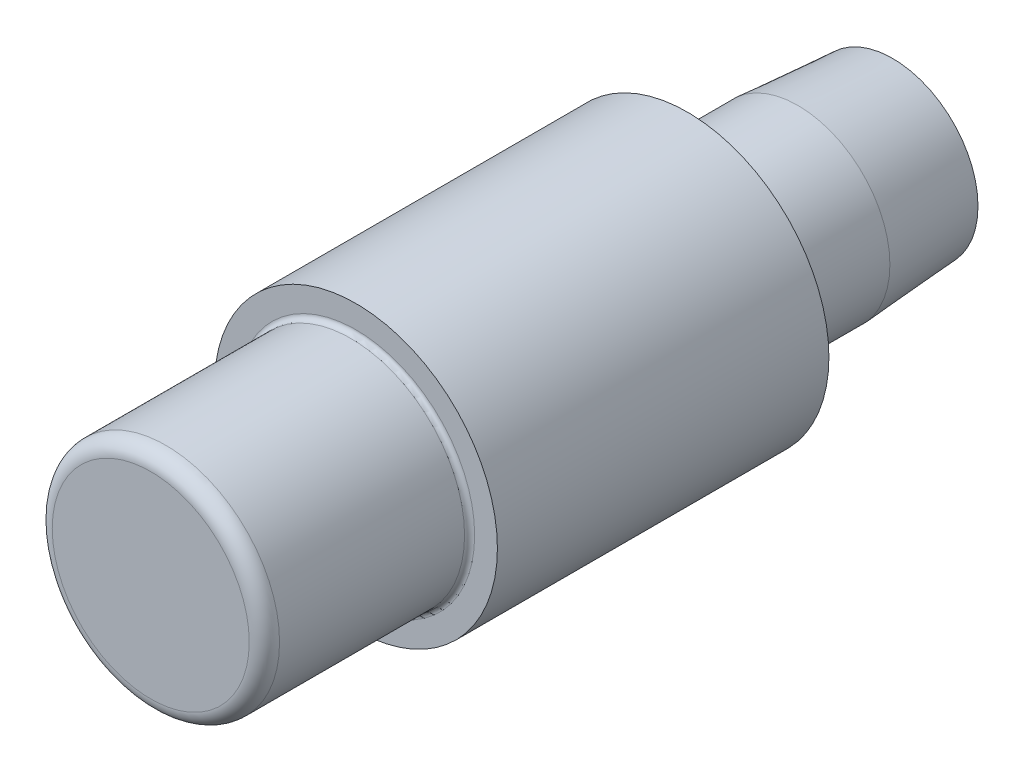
ISO-10303-21;
HEADER;
FILE_DESCRIPTION(('STEP AP214'),'2;1');
FILE_NAME('part.step','',(''),(''),'','','');
FILE_SCHEMA(('AUTOMOTIVE_DESIGN { 1 0 10303 214 1 1 1 1 }'));
ENDSEC;
DATA;
#1=APPLICATION_CONTEXT('core data for automotive mechanical design processes');
#2=APPLICATION_PROTOCOL_DEFINITION('international standard','automotive_design',2000,#1);
#3=PRODUCT_CONTEXT('',#1,'mechanical');
#4=PRODUCT('Part','Part','',(#3));
#5=PRODUCT_RELATED_PRODUCT_CATEGORY('part','',(#4));
#6=PRODUCT_DEFINITION_FORMATION('','',#4);
#7=PRODUCT_DEFINITION_CONTEXT('part definition',#1,'design');
#8=PRODUCT_DEFINITION('design','',#6,#7);
#9=PRODUCT_DEFINITION_SHAPE('','',#8);
#10=(LENGTH_UNIT() NAMED_UNIT(*) SI_UNIT(.MILLI.,.METRE.));
#11=(NAMED_UNIT(*) PLANE_ANGLE_UNIT() SI_UNIT($,.RADIAN.));
#12=(NAMED_UNIT(*) SI_UNIT($,.STERADIAN.) SOLID_ANGLE_UNIT());
#13=UNCERTAINTY_MEASURE_WITH_UNIT(LENGTH_MEASURE(1.E-05),#10,'distance_accuracy_value','');
#14=(GEOMETRIC_REPRESENTATION_CONTEXT(3) GLOBAL_UNCERTAINTY_ASSIGNED_CONTEXT((#13)) GLOBAL_UNIT_ASSIGNED_CONTEXT((#10,
#11,#12)) REPRESENTATION_CONTEXT('',''));
#15=CARTESIAN_POINT('',(0.,0.,0.));
#16=DIRECTION('',(0.,0.,1.));
#17=DIRECTION('',(1.,0.,0.));
#18=AXIS2_PLACEMENT_3D('',#15,#16,#17);
#19=CARTESIAN_POINT('',(0.,0.,13.49375));
#20=DIRECTION('',(0.,0.,1.));
#21=DIRECTION('',(1.,0.,0.));
#22=AXIS2_PLACEMENT_3D('',#19,#20,#21);
#23=PLANE('',#22);
#24=CARTESIAN_POINT('',(0.,0.,13.49375));
#25=DIRECTION('',(0.,0.,1.));
#26=DIRECTION('',(1.,0.,0.));
#27=AXIS2_PLACEMENT_3D('',#24,#25,#26);
#28=CIRCLE('',#27,2.9845);
#29=CARTESIAN_POINT('',(2.9845,0.,13.49375));
#30=VERTEX_POINT('',#29);
#31=EDGE_CURVE('E11',#30,#30,#28,.F.);
#32=ORIENTED_EDGE('',*,*,#31,.T.);
#33=EDGE_LOOP('',(#32));
#34=FACE_BOUND('',#33,.T.);
#35=CARTESIAN_POINT('',(0.,0.,13.49375));
#36=DIRECTION('',(0.,0.,1.));
#37=DIRECTION('',(1.,0.,0.));
#38=AXIS2_PLACEMENT_3D('',#35,#36,#37);
#39=CIRCLE('',#38,3.556);
#40=CARTESIAN_POINT('',(3.556,0.,13.49375));
#41=VERTEX_POINT('',#40);
#42=EDGE_CURVE('E60',#41,#41,#39,.T.);
#43=ORIENTED_EDGE('',*,*,#42,.T.);
#44=EDGE_LOOP('',(#43));
#45=FACE_BOUND('',#44,.T.);
#46=ADVANCED_FACE('F37',(#34,#45),#23,.T.);
#47=CARTESIAN_POINT('',(0.,0.,5.159375));
#48=DIRECTION('',(0.,0.,-1.));
#49=DIRECTION('',(-1.,0.,0.));
#50=AXIS2_PLACEMENT_3D('',#47,#48,#49);
#51=CYLINDRICAL_SURFACE('',#50,2.3114);
#52=CARTESIAN_POINT('',(0.,0.,4.778375));
#53=DIRECTION('',(0.,0.,1.));
#54=DIRECTION('',(1.,0.,0.));
#55=AXIS2_PLACEMENT_3D('',#52,#53,#54);
#56=CIRCLE('',#55,2.3114);
#57=CARTESIAN_POINT('',(2.3114,0.,4.778375));
#58=VERTEX_POINT('',#57);
#59=EDGE_CURVE('E80',#58,#58,#56,.F.);
#60=ORIENTED_EDGE('',*,*,#59,.T.);
#61=EDGE_LOOP('',(#60));
#62=FACE_BOUND('',#61,.T.);
#63=CARTESIAN_POINT('',(0.,0.,2.38125000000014));
#64=DIRECTION('',(0.,0.,1.));
#65=DIRECTION('',(1.,0.,0.));
#66=AXIS2_PLACEMENT_3D('',#63,#64,#65);
#67=CIRCLE('',#66,2.3114);
#68=CARTESIAN_POINT('',(2.3114,0.,2.38125000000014));
#69=VERTEX_POINT('',#68);
#70=EDGE_CURVE('E71',#69,#69,#67,.T.);
#71=ORIENTED_EDGE('',*,*,#70,.T.);
#72=EDGE_LOOP('',(#71));
#73=FACE_BOUND('',#72,.T.);
#74=ADVANCED_FACE('F102',(#62,#73),#51,.T.);
#75=CARTESIAN_POINT('',(0.,0.,0.));
#76=DIRECTION('',(0.,0.,1.));
#77=DIRECTION('',(1.,0.,0.));
#78=AXIS2_PLACEMENT_3D('',#75,#76,#77);
#79=PLANE('',#78);
#80=CARTESIAN_POINT('',(0.,0.,0.));
#81=DIRECTION('',(0.,0.,1.));
#82=DIRECTION('',(1.,0.,0.));
#83=AXIS2_PLACEMENT_3D('',#80,#81,#82);
#84=CIRCLE('',#83,1.444625);
#85=CARTESIAN_POINT('',(1.444625,0.,0.));
#86=VERTEX_POINT('',#85);
#87=EDGE_CURVE('E86',#86,#86,#84,.T.);
#88=ORIENTED_EDGE('',*,*,#87,.T.);
#89=EDGE_LOOP('',(#88));
#90=FACE_BOUND('',#89,.T.);
#91=CARTESIAN_POINT('',(0.,0.,0.));
#92=DIRECTION('',(0.,0.,1.));
#93=DIRECTION('',(1.,0.,0.));
#94=AXIS2_PLACEMENT_3D('',#91,#92,#93);
#95=CIRCLE('',#94,2.14488677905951);
#96=CARTESIAN_POINT('',(2.14488677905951,0.,0.));
#97=VERTEX_POINT('',#96);
#98=EDGE_CURVE('E74',#97,#97,#95,.F.);
#99=ORIENTED_EDGE('',*,*,#98,.T.);
#100=EDGE_LOOP('',(#99));
#101=FACE_BOUND('',#100,.T.);
#102=ADVANCED_FACE('F108',(#90,#101),#79,.F.);
#103=CARTESIAN_POINT('',(0.,0.,5.159375));
#104=DIRECTION('',(0.,0.,1.));
#105=DIRECTION('',(1.,0.,0.));
#106=AXIS2_PLACEMENT_3D('',#103,#104,#105);
#107=PLANE('',#106);
#108=CARTESIAN_POINT('',(0.,0.,5.159375));
#109=DIRECTION('',(0.,0.,1.));
#110=DIRECTION('',(1.,0.,0.));
#111=AXIS2_PLACEMENT_3D('',#108,#109,#110);
#112=CIRCLE('',#111,2.6924);
#113=CARTESIAN_POINT('',(2.6924,0.,5.159375));
#114=VERTEX_POINT('',#113);
#115=EDGE_CURVE('E77',#114,#114,#112,.T.);
#116=ORIENTED_EDGE('',*,*,#115,.T.);
#117=EDGE_LOOP('',(#116));
#118=FACE_BOUND('',#117,.T.);
#119=CARTESIAN_POINT('',(0.,0.,5.159375));
#120=DIRECTION('',(0.,0.,1.));
#121=DIRECTION('',(1.,0.,0.));
#122=AXIS2_PLACEMENT_3D('',#119,#120,#121);
#123=CIRCLE('',#122,3.556);
#124=CARTESIAN_POINT('',(3.556,0.,5.159375));
#125=VERTEX_POINT('',#124);
#126=EDGE_CURVE('E57',#125,#125,#123,.T.);
#127=ORIENTED_EDGE('',*,*,#126,.F.);
#128=EDGE_LOOP('',(#127));
#129=FACE_BOUND('',#128,.T.);
#130=ADVANCED_FACE('F115',(#118,#129),#107,.F.);
#131=CARTESIAN_POINT('',(0.,0.,13.49375));
#132=DIRECTION('',(0.,0.,-1.));
#133=DIRECTION('',(-1.,0.,0.));
#134=AXIS2_PLACEMENT_3D('',#131,#132,#133);
#135=CYLINDRICAL_SURFACE('',#134,3.556);
#136=ORIENTED_EDGE('',*,*,#42,.F.);
#137=EDGE_LOOP('',(#136));
#138=FACE_BOUND('',#137,.T.);
#139=ORIENTED_EDGE('',*,*,#126,.T.);
#140=EDGE_LOOP('',(#139));
#141=FACE_BOUND('',#140,.T.);
#142=ADVANCED_FACE('F118',(#138,#141),#135,.T.);
#143=CARTESIAN_POINT('',(0.,0.,18.653125));
#144=DIRECTION('',(0.,0.,-1.));
#145=DIRECTION('',(-1.,0.,0.));
#146=AXIS2_PLACEMENT_3D('',#143,#144,#145);
#147=CYLINDRICAL_SURFACE('',#146,2.8575);
#148=CARTESIAN_POINT('',(0.,0.,13.62075));
#149=DIRECTION('',(0.,0.,1.));
#150=DIRECTION('',(1.,0.,0.));
#151=AXIS2_PLACEMENT_3D('',#148,#149,#150);
#152=CIRCLE('',#151,2.8575);
#153=CARTESIAN_POINT('',(2.8575,0.,13.62075));
#154=VERTEX_POINT('',#153);
#155=EDGE_CURVE('E44',#154,#154,#152,.T.);
#156=ORIENTED_EDGE('',*,*,#155,.T.);
#157=EDGE_LOOP('',(#156));
#158=FACE_BOUND('',#157,.T.);
#159=CARTESIAN_POINT('',(0.,0.,18.272125));
#160=DIRECTION('',(0.,0.,1.));
#161=DIRECTION('',(1.,0.,0.));
#162=AXIS2_PLACEMENT_3D('',#159,#160,#161);
#163=CIRCLE('',#162,2.8575);
#164=CARTESIAN_POINT('',(2.8575,0.,18.272125));
#165=VERTEX_POINT('',#164);
#166=EDGE_CURVE('E68',#165,#165,#163,.F.);
#167=ORIENTED_EDGE('',*,*,#166,.T.);
#168=EDGE_LOOP('',(#167));
#169=FACE_BOUND('',#168,.T.);
#170=ADVANCED_FACE('F91',(#158,#169),#147,.T.);
#171=CARTESIAN_POINT('',(0.,0.,18.653125));
#172=DIRECTION('',(0.,0.,1.));
#173=DIRECTION('',(1.,0.,0.));
#174=AXIS2_PLACEMENT_3D('',#171,#172,#173);
#175=PLANE('',#174);
#176=CARTESIAN_POINT('',(0.,0.,18.653125));
#177=DIRECTION('',(0.,0.,1.));
#178=DIRECTION('',(1.,0.,0.));
#179=AXIS2_PLACEMENT_3D('',#176,#177,#178);
#180=CIRCLE('',#179,2.4765);
#181=CARTESIAN_POINT('',(2.4765,0.,18.653125));
#182=VERTEX_POINT('',#181);
#183=EDGE_CURVE('E64',#182,#182,#180,.T.);
#184=ORIENTED_EDGE('',*,*,#183,.T.);
#185=EDGE_LOOP('',(#184));
#186=FACE_BOUND('',#185,.T.);
#187=ADVANCED_FACE('F130',(#186),#175,.T.);
#188=CARTESIAN_POINT('',(0.,0.,18.272125));
#189=DIRECTION('',(0.,0.,1.));
#190=DIRECTION('',(1.,0.,0.));
#191=AXIS2_PLACEMENT_3D('',#188,#189,#190);
#192=TOROIDAL_SURFACE('',#191,2.4765,0.381);
#193=ORIENTED_EDGE('',*,*,#166,.F.);
#194=EDGE_LOOP('',(#193));
#195=FACE_BOUND('',#194,.T.);
#196=ORIENTED_EDGE('',*,*,#183,.F.);
#197=EDGE_LOOP('',(#196));
#198=FACE_BOUND('',#197,.T.);
#199=ADVANCED_FACE('F126',(#195,#198),#192,.T.);
#200=CARTESIAN_POINT('',(0.,0.,2.38125000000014));
#201=DIRECTION('',(0.,0.,1.));
#202=DIRECTION('',(1.,0.,0.));
#203=AXIS2_PLACEMENT_3D('',#200,#201,#202);
#204=CONICAL_SURFACE('',#203,2.3114,0.0698131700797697);
#205=ORIENTED_EDGE('',*,*,#98,.F.);
#206=EDGE_LOOP('',(#205));
#207=FACE_BOUND('',#206,.T.);
#208=ORIENTED_EDGE('',*,*,#70,.F.);
#209=EDGE_LOOP('',(#208));
#210=FACE_BOUND('',#209,.T.);
#211=ADVANCED_FACE('F129',(#207,#210),#204,.T.);
#212=CARTESIAN_POINT('',(0.,0.,4.778375));
#213=DIRECTION('',(0.,0.,1.));
#214=DIRECTION('',(1.,0.,0.));
#215=AXIS2_PLACEMENT_3D('',#212,#213,#214);
#216=TOROIDAL_SURFACE('',#215,2.6924,0.381);
#217=ORIENTED_EDGE('',*,*,#59,.F.);
#218=EDGE_LOOP('',(#217));
#219=FACE_BOUND('',#218,.T.);
#220=ORIENTED_EDGE('',*,*,#115,.F.);
#221=EDGE_LOOP('',(#220));
#222=FACE_BOUND('',#221,.T.);
#223=ADVANCED_FACE('F134',(#219,#222),#216,.F.);
#224=CARTESIAN_POINT('',(0.,0.,0.));
#225=DIRECTION('',(0.,0.,-1.));
#226=DIRECTION('',(-1.,0.,0.));
#227=AXIS2_PLACEMENT_3D('',#224,#225,#226);
#228=CYLINDRICAL_SURFACE('',#227,1.190625);
#229=CARTESIAN_POINT('',(0.,0.,0.254));
#230=DIRECTION('',(0.,0.,1.));
#231=DIRECTION('',(1.,0.,0.));
#232=AXIS2_PLACEMENT_3D('',#229,#230,#231);
#233=CIRCLE('',#232,1.190625);
#234=CARTESIAN_POINT('',(1.190625,0.,0.254));
#235=VERTEX_POINT('',#234);
#236=EDGE_CURVE('E83',#235,#235,#233,.F.);
#237=ORIENTED_EDGE('',*,*,#236,.T.);
#238=EDGE_LOOP('',(#237));
#239=FACE_BOUND('',#238,.T.);
#240=CARTESIAN_POINT('',(0.,0.,7.9375));
#241=DIRECTION('',(0.,0.,-1.));
#242=DIRECTION('',(-1.,0.,0.));
#243=AXIS2_PLACEMENT_3D('',#240,#241,#242);
#244=CIRCLE('',#243,1.190625);
#245=CARTESIAN_POINT('',(-1.190625,0.,7.9375));
#246=VERTEX_POINT('',#245);
#247=EDGE_CURVE('E55',#246,#246,#244,.T.);
#248=ORIENTED_EDGE('',*,*,#247,.F.);
#249=EDGE_LOOP('',(#248));
#250=FACE_BOUND('',#249,.T.);
#251=ADVANCED_FACE('F51',(#239,#250),#228,.F.);
#252=CARTESIAN_POINT('',(0.,0.,7.9375));
#253=DIRECTION('',(0.,0.,-1.));
#254=DIRECTION('',(-1.,0.,0.));
#255=AXIS2_PLACEMENT_3D('',#252,#253,#254);
#256=CONICAL_SURFACE('',#255,1.190625,1.02974425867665);
#257=CARTESIAN_POINT('',(0.,0.,8.65289967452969));
#258=VERTEX_POINT('',#257);
#259=VERTEX_LOOP('',#258);
#260=FACE_BOUND('',#259,.T.);
#261=ORIENTED_EDGE('',*,*,#247,.T.);
#262=EDGE_LOOP('',(#261));
#263=FACE_BOUND('',#262,.T.);
#264=ADVANCED_FACE('F47',(#260,#263),#256,.F.);
#265=CARTESIAN_POINT('',(0.,0.,0.254));
#266=DIRECTION('',(0.,0.,-1.));
#267=DIRECTION('',(-1.,0.,0.));
#268=AXIS2_PLACEMENT_3D('',#265,#266,#267);
#269=CONICAL_SURFACE('',#268,1.190625,0.78539816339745);
#270=ORIENTED_EDGE('',*,*,#87,.F.);
#271=EDGE_LOOP('',(#270));
#272=FACE_BOUND('',#271,.T.);
#273=ORIENTED_EDGE('',*,*,#236,.F.);
#274=EDGE_LOOP('',(#273));
#275=FACE_BOUND('',#274,.T.);
#276=ADVANCED_FACE('F50',(#272,#275),#269,.F.);
#277=CARTESIAN_POINT('',(0.,0.,13.62075));
#278=DIRECTION('',(0.,0.,1.));
#279=DIRECTION('',(1.,0.,0.));
#280=AXIS2_PLACEMENT_3D('',#277,#278,#279);
#281=TOROIDAL_SURFACE('',#280,2.9845,0.127);
#282=ORIENTED_EDGE('',*,*,#31,.F.);
#283=EDGE_LOOP('',(#282));
#284=FACE_BOUND('',#283,.T.);
#285=ORIENTED_EDGE('',*,*,#155,.F.);
#286=EDGE_LOOP('',(#285));
#287=FACE_BOUND('',#286,.T.);
#288=ADVANCED_FACE('F39',(#284,#287),#281,.F.);
#289=CLOSED_SHELL('',(#46,#74,#102,#130,#142,#170,#187,#199,#211,#223,#251,#264,#276,#288));
#290=MANIFOLD_SOLID_BREP('B2',#289);
#291=ADVANCED_BREP_SHAPE_REPRESENTATION('',(#18,#290),#14);
#292=SHAPE_DEFINITION_REPRESENTATION(#9,#291);
ENDSEC;
END-ISO-10303-21;
